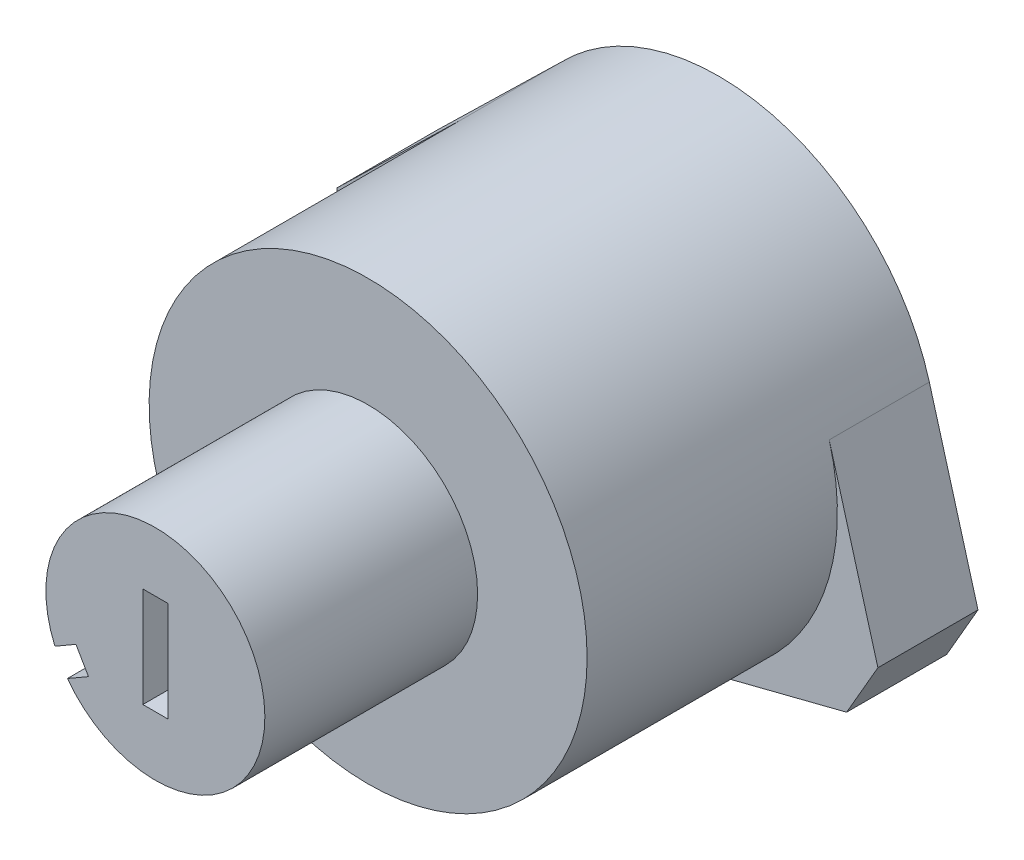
from build123d import *

# Parameters (mm, degrees)
BOSS_EXTRUDE1_DEPTH = 10.16
SKETCH2_R           = 22.225
BOSS_EXTRUDE2_DEPTH = 25.4
BOSS_EXTRUDE3_DEPTH = 21.59
SKETCH4_W           = 2.54
SKETCH4_H           = 10.16
CUT_EXTRUDE1_DEPTH  = 2.54


with BuildPart() as part:
    # Sketch1 → Boss-Extrude1 (new body)
    with BuildSketch(Plane.XY):
        with BuildLine():
            Line((-28.575, -3.175), (-28.575, 3.175))
            Line((-28.575, 3.175), (-15.98715933, 15.438955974))
            ThreePointArc((-15.98715933, 15.438955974), (5.430585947, 21.551319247), (21.39432576, 6.019422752))
            Line((21.39432576, 6.019422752), (26.334175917, -11.537869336))
            Line((26.334175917, -11.537869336), (23.159175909, -17.037130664))
            Line((23.159175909, -17.037130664), (5.48418986, -21.537740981))
            ThreePointArc((5.48418986, -21.537740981), (-6.827380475, -21.150354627), (-17.041811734, -14.266298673))
            Line((-17.041811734, -14.266298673), (-28.575, -3.175))
        make_face()
    extrude(amount=BOSS_EXTRUDE1_DEPTH)

    # Sketch2 → Boss-Extrude2 (add)
    with BuildSketch(Plane.XY.offset(10.16)):
        with Locations(Location((0, 0, 0), (0, 0, 219.933883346))):
            Circle(SKETCH2_R)
    extrude(amount=BOSS_EXTRUDE2_DEPTH)

    # Sketch3 → Boss-Extrude3 (add)
    with BuildSketch(Plane.XY.offset(35.56)):
        with BuildLine():
            Line((-8.925652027, -6.619697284), (-6.789002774, -5.386102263))
            Line((-6.789002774, -5.386102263), (-8.059002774, -3.186397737))
            Line((-8.059002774, -3.186397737), (-10.195652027, -4.419992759))
            ThreePointArc((-10.195652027, -4.419992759), (9.6237073, 5.55625), (-8.925652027, -6.619697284))
        make_face()
    extrude(amount=BOSS_EXTRUDE3_DEPTH)

    # Sketch4 → Cut-Extrude1 (cut)
    with BuildSketch(Plane.XY.offset(57.15)):
        Rectangle(SKETCH4_W, SKETCH4_H)
    extrude(amount=-CUT_EXTRUDE1_DEPTH, mode=Mode.SUBTRACT)


solid = part.part
